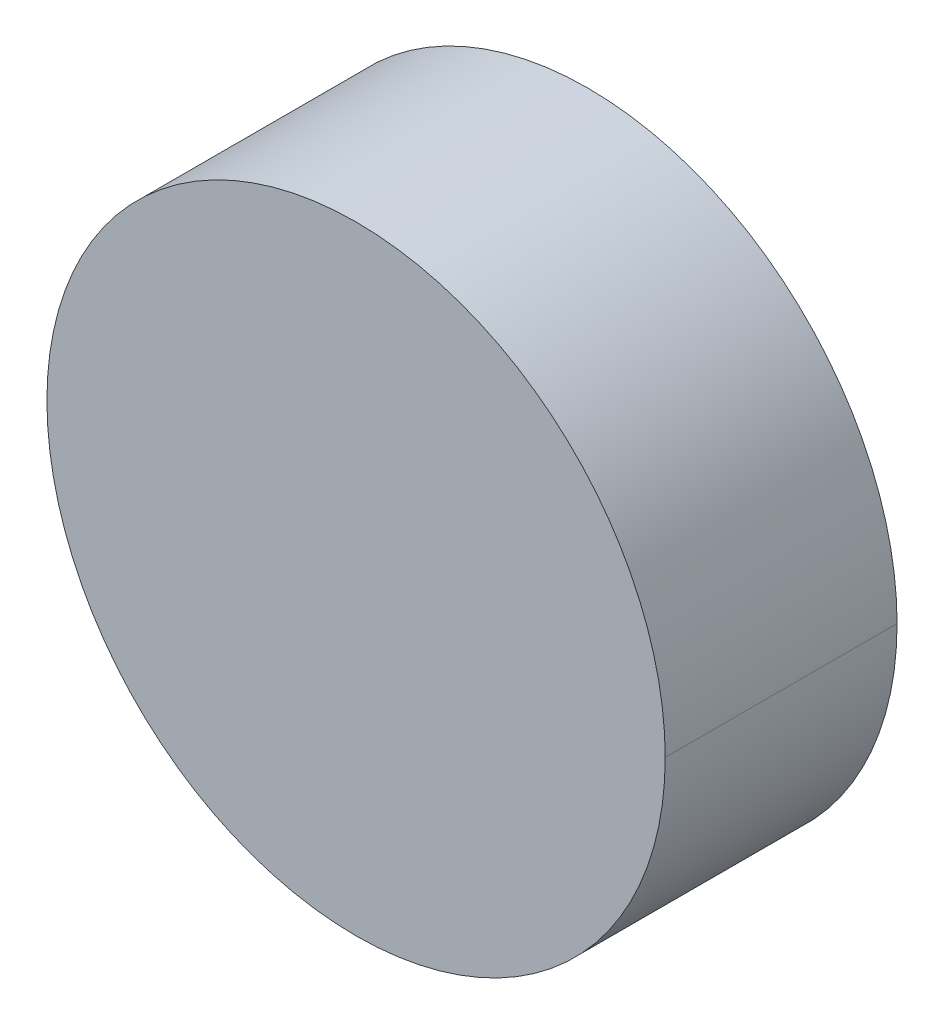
ISO-10303-21;
HEADER;
FILE_DESCRIPTION(('STEP AP214'),'2;1');
FILE_NAME('part.step','',(''),(''),'','','');
FILE_SCHEMA(('AUTOMOTIVE_DESIGN { 1 0 10303 214 1 1 1 1 }'));
ENDSEC;
DATA;
#1=APPLICATION_CONTEXT('core data for automotive mechanical design processes');
#2=APPLICATION_PROTOCOL_DEFINITION('international standard','automotive_design',2000,#1);
#3=PRODUCT_CONTEXT('',#1,'mechanical');
#4=PRODUCT('Part','Part','',(#3));
#5=PRODUCT_RELATED_PRODUCT_CATEGORY('part','',(#4));
#6=PRODUCT_DEFINITION_FORMATION('','',#4);
#7=PRODUCT_DEFINITION_CONTEXT('part definition',#1,'design');
#8=PRODUCT_DEFINITION('design','',#6,#7);
#9=PRODUCT_DEFINITION_SHAPE('','',#8);
#10=(LENGTH_UNIT() NAMED_UNIT(*) SI_UNIT(.MILLI.,.METRE.));
#11=(NAMED_UNIT(*) PLANE_ANGLE_UNIT() SI_UNIT($,.RADIAN.));
#12=(NAMED_UNIT(*) SI_UNIT($,.STERADIAN.) SOLID_ANGLE_UNIT());
#13=UNCERTAINTY_MEASURE_WITH_UNIT(LENGTH_MEASURE(1.E-05),#10,'distance_accuracy_value','');
#14=(GEOMETRIC_REPRESENTATION_CONTEXT(3) GLOBAL_UNCERTAINTY_ASSIGNED_CONTEXT((#13)) GLOBAL_UNIT_ASSIGNED_CONTEXT((#10,
#11,#12)) REPRESENTATION_CONTEXT('',''));
#15=CARTESIAN_POINT('',(0.,0.,0.));
#16=DIRECTION('',(0.,0.,1.));
#17=DIRECTION('',(1.,0.,0.));
#18=AXIS2_PLACEMENT_3D('',#15,#16,#17);
#19=CARTESIAN_POINT('',(25.4,0.,9.525));
#20=DIRECTION('',(0.,0.,1.));
#21=DIRECTION('',(1.,0.,0.));
#22=AXIS2_PLACEMENT_3D('',#19,#20,#21);
#23=PLANE('',#22);
#24=CARTESIAN_POINT('',(0.,0.,9.525));
#25=DIRECTION('',(0.,0.,1.));
#26=DIRECTION('',(1.,0.,0.));
#27=AXIS2_PLACEMENT_3D('',#24,#25,#26);
#28=CIRCLE('',#27,25.4);
#29=CARTESIAN_POINT('',(25.4,0.,9.525));
#30=VERTEX_POINT('',#29);
#31=CARTESIAN_POINT('',(-25.4,0.,9.525));
#32=VERTEX_POINT('',#31);
#33=EDGE_CURVE('E19',#30,#32,#28,.F.);
#34=ORIENTED_EDGE('',*,*,#33,.F.);
#35=CARTESIAN_POINT('',(0.,0.,9.525));
#36=DIRECTION('',(0.,0.,1.));
#37=DIRECTION('',(1.,0.,0.));
#38=AXIS2_PLACEMENT_3D('',#35,#36,#37);
#39=CIRCLE('',#38,25.4);
#40=EDGE_CURVE('E49',#32,#30,#39,.F.);
#41=ORIENTED_EDGE('',*,*,#40,.F.);
#42=EDGE_LOOP('',(#34,#41));
#43=FACE_BOUND('',#42,.T.);
#44=ADVANCED_FACE('F16',(#43),#23,.T.);
#45=CARTESIAN_POINT('',(0.,0.,-3.175));
#46=DIRECTION('',(0.,0.,1.));
#47=DIRECTION('',(1.,0.,0.));
#48=AXIS2_PLACEMENT_3D('',#45,#46,#47);
#49=CYLINDRICAL_SURFACE('',#48,25.4);
#50=DIRECTION('',(0.,0.,1.));
#51=VECTOR('',#50,1.);
#52=CARTESIAN_POINT('',(-25.4,0.,-3.175));
#53=LINE('',#52,#51);
#54=CARTESIAN_POINT('',(-25.4,0.,-9.525));
#55=VERTEX_POINT('',#54);
#56=EDGE_CURVE('E47',#55,#32,#53,.T.);
#57=ORIENTED_EDGE('',*,*,#56,.F.);
#58=CARTESIAN_POINT('',(0.,0.,-9.525));
#59=DIRECTION('',(0.,0.,1.));
#60=DIRECTION('',(1.,0.,0.));
#61=AXIS2_PLACEMENT_3D('',#58,#59,#60);
#62=CIRCLE('',#61,25.4);
#63=CARTESIAN_POINT('',(25.4,0.,-9.525));
#64=VERTEX_POINT('',#63);
#65=EDGE_CURVE('E25',#55,#64,#62,.T.);
#66=ORIENTED_EDGE('',*,*,#65,.T.);
#67=DIRECTION('',(0.,0.,1.));
#68=VECTOR('',#67,1.);
#69=CARTESIAN_POINT('',(25.4,0.,-3.175));
#70=LINE('',#69,#68);
#71=EDGE_CURVE('E33',#30,#64,#70,.F.);
#72=ORIENTED_EDGE('',*,*,#71,.F.);
#73=ORIENTED_EDGE('',*,*,#33,.T.);
#74=EDGE_LOOP('',(#57,#66,#72,#73));
#75=FACE_BOUND('',#74,.T.);
#76=ADVANCED_FACE('F45',(#75),#49,.T.);
#77=CARTESIAN_POINT('',(0.,0.,-3.175));
#78=DIRECTION('',(0.,0.,1.));
#79=DIRECTION('',(1.,0.,0.));
#80=AXIS2_PLACEMENT_3D('',#77,#78,#79);
#81=CYLINDRICAL_SURFACE('',#80,25.4);
#82=ORIENTED_EDGE('',*,*,#56,.T.);
#83=ORIENTED_EDGE('',*,*,#40,.T.);
#84=ORIENTED_EDGE('',*,*,#71,.T.);
#85=CARTESIAN_POINT('',(0.,0.,-9.525));
#86=DIRECTION('',(0.,0.,1.));
#87=DIRECTION('',(1.,0.,0.));
#88=AXIS2_PLACEMENT_3D('',#85,#86,#87);
#89=CIRCLE('',#88,25.4);
#90=EDGE_CURVE('E11',#64,#55,#89,.T.);
#91=ORIENTED_EDGE('',*,*,#90,.T.);
#92=EDGE_LOOP('',(#82,#83,#84,#91));
#93=FACE_BOUND('',#92,.T.);
#94=ADVANCED_FACE('F48',(#93),#81,.T.);
#95=CARTESIAN_POINT('',(0.,-1.80477854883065E-13,-9.525));
#96=DIRECTION('',(0.,0.,1.));
#97=DIRECTION('',(1.,0.,0.));
#98=AXIS2_PLACEMENT_3D('',#95,#96,#97);
#99=PLANE('',#98);
#100=ORIENTED_EDGE('',*,*,#65,.F.);
#101=ORIENTED_EDGE('',*,*,#90,.F.);
#102=EDGE_LOOP('',(#100,#101));
#103=FACE_BOUND('',#102,.T.);
#104=ADVANCED_FACE('F54',(#103),#99,.F.);
#105=CLOSED_SHELL('',(#44,#76,#94,#104));
#106=MANIFOLD_SOLID_BREP('B1',#105);
#107=ADVANCED_BREP_SHAPE_REPRESENTATION('',(#18,#106),#14);
#108=SHAPE_DEFINITION_REPRESENTATION(#9,#107);
ENDSEC;
END-ISO-10303-21;
